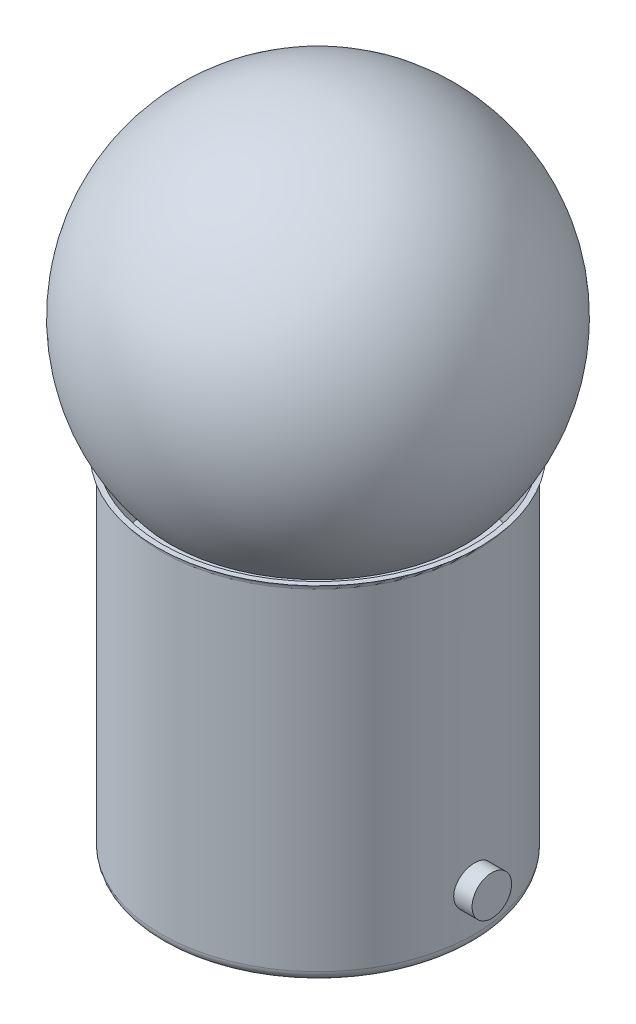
from build123d import *

# Parameters (mm, degrees)
SKETCH1_R                = 7.5565
BOSS_EXTRUDE1_DEPTH      = 16.4846
FILLET1_R                = 0.508
BOSS_EXTRUDE2_DEPTH      = 8.382
BOSS_EXTRUDE2_DEPTH_BACK = 8.4582
SKETCH4_R                = 0.9525
CUT_EXTRUDE1_START       = -5.4356
SKETCH5_R                = 7.511107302
CUT_EXTRUDE1_DEPTH       = 5.4356


with BuildPart() as part:
    # Sketch1 → Boss-Extrude1 (new body)
    with BuildSketch(Plane(origin=(0, 0, 0), x_dir=(1, 0, 0), z_dir=(0, 1, 0))):
        with Locations(Location((0, 0, 0), (0, 0, 270))):
            Circle(SKETCH1_R)
    extrude(amount=BOSS_EXTRUDE1_DEPTH)

    # Sketch2 → Revolve1 (revolve)
    with BuildSketch(Plane(origin=(0, 0, 0), x_dir=(0, 0, -1), z_dir=(1, 0, 0)), mode=Mode.PRIVATE) as revolve1_sk:
        with BuildLine():
            Line((7.5565, 14.095430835), (7.5565, 16.4846))
            ThreePointArc((7.5565, 16.4846), (7.615103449, 16.662676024), (7.768007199, 16.771146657))
            Line((7.768007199, 16.771146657), (7.511107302, 16.771146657))
            Line((7.511107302, 16.771146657), (7.511107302, 14.095430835))
            Line((7.511107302, 14.095430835), (7.5565, 14.095430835))
        make_face()
    revolve(revolve1_sk.sketch.rotate(Axis((0, 16.4846, 0), (0, -1, 0)), 180), axis=Axis((0, 16.4846, 0), (0, -1, 0)))

    # Fillet1
    fillet1_edges = [part.edges().sort_by_distance(p)[0] for p in [
        (0, 0, -7.5565),
    ]]
    fillet(fillet1_edges, radius=FILLET1_R)

    # Sketch3 → Revolve2 (revolve)
    with BuildSketch(Plane(origin=(0, 0, 0), x_dir=(0, 0, -1), z_dir=(1, 0, 0)), mode=Mode.PRIVATE) as revolve2_sk:
        with BuildLine():
            Line((3.8862, 0), (1.062006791, -2.74403137))
            ThreePointArc((1.062006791, -2.74403137), (0.57306029, -3.06315364), (0, -3.175))
            Line((0, -3.175), (0, 0))
            Line((0, 0), (3.8862, 0))
        make_face()
    revolve(revolve2_sk.sketch.rotate(Axis((0, 0, 0), (0, -1, 0)), 180), axis=Axis((0, 0, 0), (0, -1, 0)))

    # Sketch4 → Boss-Extrude2 (add, two sides: drawn at the far end of the back side and taken through both)
    with BuildSketch(Plane(origin=(0, 0, 0), x_dir=(0, 0, -1), z_dir=(1, 0, 0)).offset(-BOSS_EXTRUDE2_DEPTH_BACK)):
        with Locations((0, 2.54)):
            Circle(SKETCH4_R)
    extrude(amount=BOSS_EXTRUDE2_DEPTH + BOSS_EXTRUDE2_DEPTH_BACK)

    # Sketch5 → Cut-Extrude1 (cut)
    with BuildSketch(Plane(origin=(0, 16.4846, 0), x_dir=(1, 0, 0), z_dir=(0, 1, 0)).offset(CUT_EXTRUDE1_START)):
        with Locations(Location((0, 0, 0), (0, 0, 270))):
            Circle(SKETCH5_R)
    extrude(amount=CUT_EXTRUDE1_DEPTH, mode=Mode.SUBTRACT)


with BuildPart() as body_2:
    # Sketch6 → Revolve3 (revolve)
    with BuildSketch(Plane(origin=(0, 0, 0), x_dir=(0, 0, -1), z_dir=(1, 0, 0))):
        with BuildLine():
            Line((0, 16.563965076), (7.111826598, 16.563965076))
            ThreePointArc((7.111826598, 16.563965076), (8.384416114, 26.418236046), (0, 31.75))
            Line((0, 31.75), (0, 16.563965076))
        make_face()
    revolve(axis=Axis((0, 16.4846, 0), (0, -1, 0)))


solid = Compound([part.part, body_2.part])
